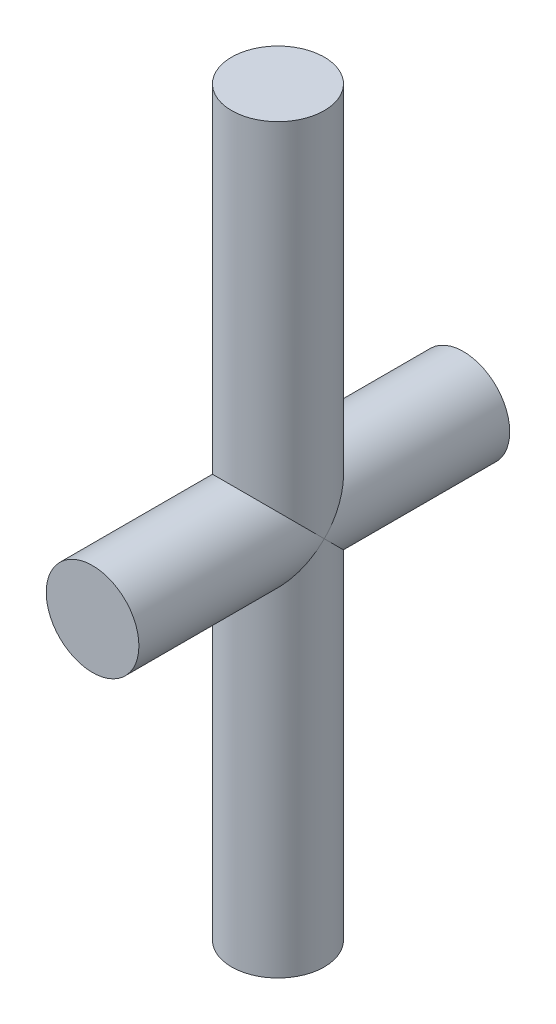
ISO-10303-21;
HEADER;
FILE_DESCRIPTION(('STEP AP214'),'2;1');
FILE_NAME('part.step','',(''),(''),'','','');
FILE_SCHEMA(('AUTOMOTIVE_DESIGN { 1 0 10303 214 1 1 1 1 }'));
ENDSEC;
DATA;
#1=APPLICATION_CONTEXT('core data for automotive mechanical design processes');
#2=APPLICATION_PROTOCOL_DEFINITION('international standard','automotive_design',2000,#1);
#3=PRODUCT_CONTEXT('',#1,'mechanical');
#4=PRODUCT('Part','Part','',(#3));
#5=PRODUCT_RELATED_PRODUCT_CATEGORY('part','',(#4));
#6=PRODUCT_DEFINITION_FORMATION('','',#4);
#7=PRODUCT_DEFINITION_CONTEXT('part definition',#1,'design');
#8=PRODUCT_DEFINITION('design','',#6,#7);
#9=PRODUCT_DEFINITION_SHAPE('','',#8);
#10=(LENGTH_UNIT() NAMED_UNIT(*) SI_UNIT(.MILLI.,.METRE.));
#11=(NAMED_UNIT(*) PLANE_ANGLE_UNIT() SI_UNIT($,.RADIAN.));
#12=(NAMED_UNIT(*) SI_UNIT($,.STERADIAN.) SOLID_ANGLE_UNIT());
#13=UNCERTAINTY_MEASURE_WITH_UNIT(LENGTH_MEASURE(1.E-05),#10,'distance_accuracy_value','');
#14=(GEOMETRIC_REPRESENTATION_CONTEXT(3) GLOBAL_UNCERTAINTY_ASSIGNED_CONTEXT((#13)) GLOBAL_UNIT_ASSIGNED_CONTEXT((#10,
#11,#12)) REPRESENTATION_CONTEXT('',''));
#15=CARTESIAN_POINT('',(0.,0.,0.));
#16=DIRECTION('',(0.,0.,1.));
#17=DIRECTION('',(1.,0.,0.));
#18=AXIS2_PLACEMENT_3D('',#15,#16,#17);
#19=CARTESIAN_POINT('',(0.,0.,50.));
#20=DIRECTION('',(0.,0.,-1.));
#21=DIRECTION('',(-1.,0.,0.));
#22=AXIS2_PLACEMENT_3D('',#19,#20,#21);
#23=CYLINDRICAL_SURFACE('',#22,12.5);
#24=CARTESIAN_POINT('',(0.,0.,50.));
#25=DIRECTION('',(0.,0.,1.));
#26=DIRECTION('',(1.,0.,0.));
#27=AXIS2_PLACEMENT_3D('',#24,#25,#26);
#28=CIRCLE('',#27,12.5);
#29=CARTESIAN_POINT('',(12.5,0.,50.));
#30=VERTEX_POINT('',#29);
#31=EDGE_CURVE('E56',#30,#30,#28,.T.);
#32=ORIENTED_EDGE('',*,*,#31,.F.);
#33=EDGE_LOOP('',(#32));
#34=FACE_BOUND('',#33,.T.);
#35=CARTESIAN_POINT('',(0.,0.,0.));
#36=DIRECTION('',(0.,-0.707106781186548,-0.707106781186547));
#37=DIRECTION('',(0.,0.707106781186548,-0.707106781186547));
#38=AXIS2_PLACEMENT_3D('',#35,#36,#37);
#39=ELLIPSE('',#38,17.6776695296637,12.5);
#40=CARTESIAN_POINT('',(12.5,0.,0.));
#41=VERTEX_POINT('',#40);
#42=CARTESIAN_POINT('',(-12.5,0.,0.));
#43=VERTEX_POINT('',#42);
#44=EDGE_CURVE('E40',#41,#43,#39,.T.);
#45=ORIENTED_EDGE('',*,*,#44,.F.);
#46=CARTESIAN_POINT('',(0.,0.,0.));
#47=DIRECTION('',(0.,0.707106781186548,-0.707106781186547));
#48=DIRECTION('',(0.,-0.707106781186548,-0.707106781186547));
#49=AXIS2_PLACEMENT_3D('',#46,#47,#48);
#50=ELLIPSE('',#49,17.6776695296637,12.5);
#51=EDGE_CURVE('E52',#43,#41,#50,.T.);
#52=ORIENTED_EDGE('',*,*,#51,.F.);
#53=EDGE_LOOP('',(#45,#52));
#54=FACE_BOUND('',#53,.T.);
#55=ADVANCED_FACE('F32',(#34,#54),#23,.T.);
#56=CARTESIAN_POINT('',(0.,0.,50.));
#57=DIRECTION('',(0.,0.,1.));
#58=DIRECTION('',(1.,0.,0.));
#59=AXIS2_PLACEMENT_3D('',#56,#57,#58);
#60=PLANE('',#59);
#61=ORIENTED_EDGE('',*,*,#31,.T.);
#62=EDGE_LOOP('',(#61));
#63=FACE_BOUND('',#62,.T.);
#64=ADVANCED_FACE('F79',(#63),#60,.T.);
#65=CARTESIAN_POINT('',(0.,-100.,0.));
#66=DIRECTION('',(0.,1.,0.));
#67=DIRECTION('',(0.,0.,1.));
#68=AXIS2_PLACEMENT_3D('',#65,#66,#67);
#69=PLANE('',#68);
#70=CARTESIAN_POINT('',(0.,-100.,0.));
#71=DIRECTION('',(0.,1.,0.));
#72=DIRECTION('',(0.,0.,1.));
#73=AXIS2_PLACEMENT_3D('',#70,#71,#72);
#74=CIRCLE('',#73,12.5);
#75=CARTESIAN_POINT('',(0.,-100.,12.5));
#76=VERTEX_POINT('',#75);
#77=EDGE_CURVE('E93',#76,#76,#74,.T.);
#78=ORIENTED_EDGE('',*,*,#77,.F.);
#79=EDGE_LOOP('',(#78));
#80=FACE_BOUND('',#79,.T.);
#81=ADVANCED_FACE('F76',(#80),#69,.F.);
#82=CARTESIAN_POINT('',(0.,100.,0.));
#83=DIRECTION('',(0.,-1.,0.));
#84=DIRECTION('',(0.,0.,-1.));
#85=AXIS2_PLACEMENT_3D('',#82,#83,#84);
#86=CYLINDRICAL_SURFACE('',#85,12.5);
#87=ORIENTED_EDGE('',*,*,#77,.T.);
#88=EDGE_LOOP('',(#87));
#89=FACE_BOUND('',#88,.T.);
#90=CARTESIAN_POINT('',(0.,0.,0.));
#91=DIRECTION('',(0.,0.707106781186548,-0.707106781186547));
#92=DIRECTION('',(0.,-0.707106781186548,-0.707106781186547));
#93=AXIS2_PLACEMENT_3D('',#90,#91,#92);
#94=ELLIPSE('',#93,17.6776695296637,12.5);
#95=EDGE_CURVE('E46',#43,#41,#94,.F.);
#96=ORIENTED_EDGE('',*,*,#95,.T.);
#97=ORIENTED_EDGE('',*,*,#44,.T.);
#98=EDGE_LOOP('',(#96,#97));
#99=FACE_BOUND('',#98,.T.);
#100=ADVANCED_FACE('F58',(#89,#99),#86,.T.);
#101=CARTESIAN_POINT('',(0.,0.,-50.));
#102=DIRECTION('',(0.,0.,1.));
#103=DIRECTION('',(1.,0.,0.));
#104=AXIS2_PLACEMENT_3D('',#101,#102,#103);
#105=PLANE('',#104);
#106=CARTESIAN_POINT('',(0.,0.,-50.));
#107=DIRECTION('',(0.,0.,1.));
#108=DIRECTION('',(1.,0.,0.));
#109=AXIS2_PLACEMENT_3D('',#106,#107,#108);
#110=CIRCLE('',#109,12.5);
#111=CARTESIAN_POINT('',(12.5,0.,-50.));
#112=VERTEX_POINT('',#111);
#113=EDGE_CURVE('E87',#112,#112,#110,.T.);
#114=ORIENTED_EDGE('',*,*,#113,.F.);
#115=EDGE_LOOP('',(#114));
#116=FACE_BOUND('',#115,.T.);
#117=ADVANCED_FACE('F70',(#116),#105,.F.);
#118=ORIENTED_EDGE('',*,*,#113,.T.);
#119=EDGE_LOOP('',(#118));
#120=FACE_BOUND('',#119,.T.);
#121=CARTESIAN_POINT('',(0.,0.,0.));
#122=DIRECTION('',(0.,-0.707106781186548,-0.707106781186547));
#123=DIRECTION('',(0.,0.707106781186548,-0.707106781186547));
#124=AXIS2_PLACEMENT_3D('',#121,#122,#123);
#125=ELLIPSE('',#124,17.6776695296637,12.5);
#126=EDGE_CURVE('E11',#41,#43,#125,.F.);
#127=ORIENTED_EDGE('',*,*,#126,.F.);
#128=ORIENTED_EDGE('',*,*,#95,.F.);
#129=EDGE_LOOP('',(#127,#128));
#130=FACE_BOUND('',#129,.T.);
#131=ADVANCED_FACE('F34',(#120,#130),#23,.T.);
#132=CARTESIAN_POINT('',(0.,100.,0.));
#133=DIRECTION('',(0.,1.,0.));
#134=DIRECTION('',(0.,0.,1.));
#135=AXIS2_PLACEMENT_3D('',#132,#133,#134);
#136=CIRCLE('',#135,12.5);
#137=CARTESIAN_POINT('',(0.,100.,12.5));
#138=VERTEX_POINT('',#137);
#139=EDGE_CURVE('E90',#138,#138,#136,.T.);
#140=ORIENTED_EDGE('',*,*,#139,.F.);
#141=EDGE_LOOP('',(#140));
#142=FACE_BOUND('',#141,.T.);
#143=ORIENTED_EDGE('',*,*,#51,.T.);
#144=ORIENTED_EDGE('',*,*,#126,.T.);
#145=EDGE_LOOP('',(#143,#144));
#146=FACE_BOUND('',#145,.T.);
#147=ADVANCED_FACE('F59',(#142,#146),#86,.T.);
#148=CARTESIAN_POINT('',(0.,100.,0.));
#149=DIRECTION('',(0.,1.,0.));
#150=DIRECTION('',(0.,0.,1.));
#151=AXIS2_PLACEMENT_3D('',#148,#149,#150);
#152=PLANE('',#151);
#153=ORIENTED_EDGE('',*,*,#139,.T.);
#154=EDGE_LOOP('',(#153));
#155=FACE_BOUND('',#154,.T.);
#156=ADVANCED_FACE('F61',(#155),#152,.T.);
#157=CLOSED_SHELL('',(#55,#64,#81,#100,#117,#131,#147,#156));
#158=MANIFOLD_SOLID_BREP('B2',#157);
#159=ADVANCED_BREP_SHAPE_REPRESENTATION('',(#18,#158),#14);
#160=SHAPE_DEFINITION_REPRESENTATION(#9,#159);
ENDSEC;
END-ISO-10303-21;
